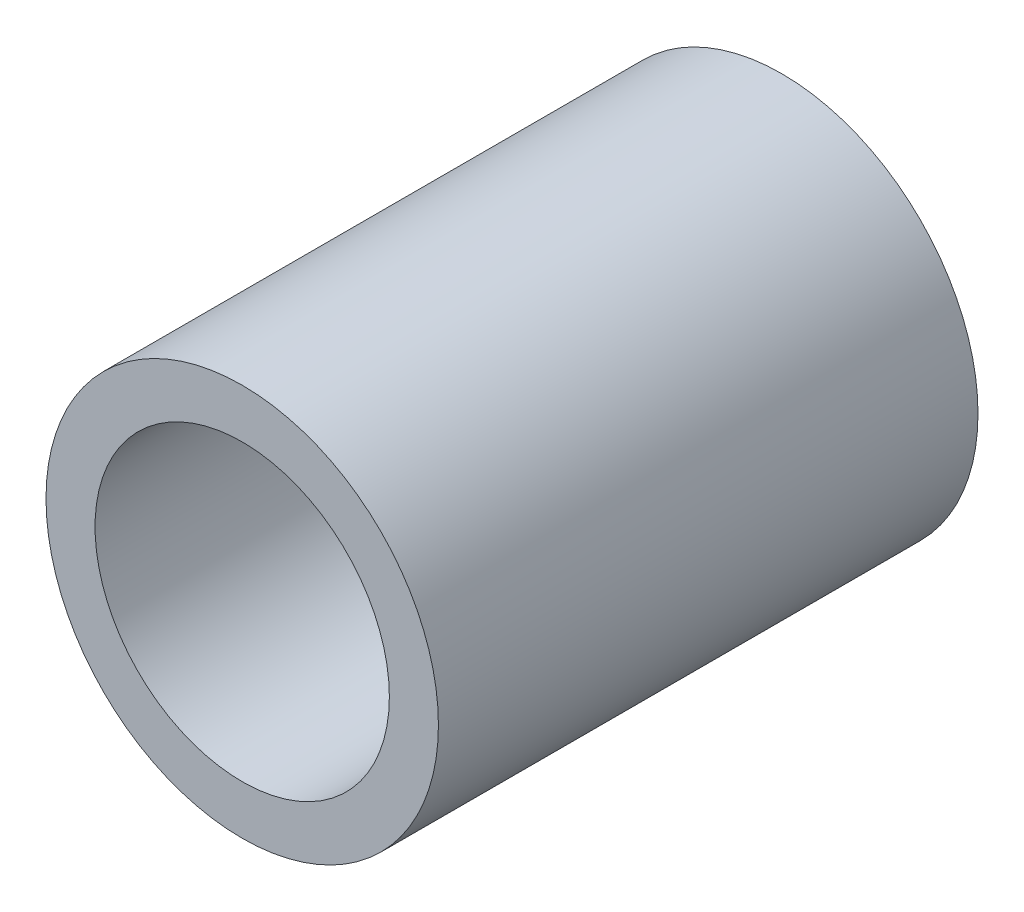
from build123d import *

# Parameters (mm, degrees)
ESQUISSE1_R      = 4
ESQUISSE1_R_2    = 3
EXTRUSION1_DEPTH = 11


with BuildPart() as part:
    # Esquisse1 → Extrusion1 (new body)
    with BuildSketch(Plane.XY):
        Circle(ESQUISSE1_R)
        Circle(ESQUISSE1_R_2, mode=Mode.SUBTRACT)
    extrude(amount=EXTRUSION1_DEPTH)


solid = part.part
